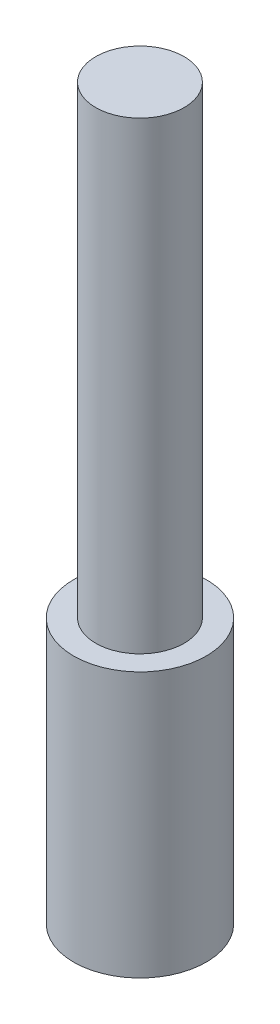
from build123d import *

# Parameters (mm, degrees)
SKETCH1_R           = 1.5
BOSS_EXTRUDE1_DEPTH = 6
SKETCH2_R           = 1
BOSS_EXTRUDE2_DEPTH = 10.5
SKETCH3_W           = 1
SKETCH3_H           = 1.5
CUT_EXTRUDE1_DEPTH  = 1


with BuildPart() as part:
    # Sketch1 → Boss-Extrude1 (new body)
    with BuildSketch(Plane(origin=(0, 0, 0), x_dir=(1, 0, 0), z_dir=(0, 1, 0))):
        with Locations(Location((1.5, 0, 0), (0, 0, 270))):
            Circle(SKETCH1_R)
    extrude(amount=BOSS_EXTRUDE1_DEPTH)

    # Sketch2 → Boss-Extrude2 (add)
    with BuildSketch(Plane(origin=(0, 6, 0), x_dir=(1, 0, 0), z_dir=(0, 1, 0))):
        with Locations(Location((1.5, 0, 0), (0, 0, 90))):
            Circle(SKETCH2_R)
    extrude(amount=BOSS_EXTRUDE2_DEPTH)

    # Sketch3 → Cut-Extrude1 (cut)
    with BuildSketch(Plane.ZY.offset(-0.5)):
        with Locations((0, 6.75)):
            Rectangle(SKETCH3_W, SKETCH3_H)
        with Locations((0, 12.75)):
            Rectangle(SKETCH3_W, SKETCH3_H)
    extrude(amount=-CUT_EXTRUDE1_DEPTH, mode=Mode.SUBTRACT)


solid = part.part
